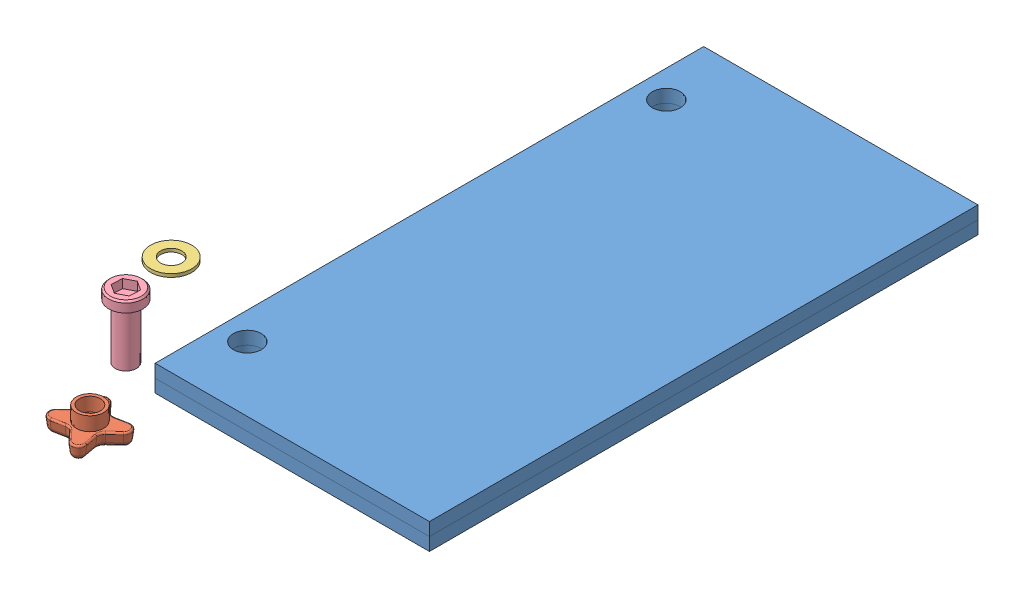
SolidWorks assembly PlateAssem1.SLDASM, configuration Default (file format 4628). Lengths in mm.
Overall size (176.96 30.99 293.86).
5 component instances, 4 part files, 5 mates.
Components (placement in the parent):
- Plate-1: Plate.SLDPRT [Default] at (-59.2503 9.0034 24.4694) size (127 6 254)
- Nut-2: Nut.SLDPRT [Default] at (-133.2012 -3.3466 171.2207) x (0.446921 0 0.894573) z (0.894573 0 -0.446921) size (29.99 12.7 29.99)
- Washer-2: Washer.SLDPRT [Default] at (-160.1384 15.0034 106.6469) x (0.913923 0 -0.405888) z (0 1 0) size (19.05 19.05 1.52)
- Cap Screw-2: Cap Screw.SLDPRT [Default] at (-153.7027 -8.8726 134.0772) x (-0.887199 0 0.461387) z (0 1 0) size (15.88 15.88 30.16)
- Plate-3: Plate.SLDPRT [Default] at (-59.2503 3.0034 24.4694) size (127 6 254)
Mates (geometry in assembly coordinates):
- Coincident2: coincident anti-aligned: plane of Plate-1 through (-122.7503 15.0034 151.4694) normal (0 1 0); plane of Washer-2 through (-160.1384 15.0034 106.6469) normal (0 -1 0)
- Coincident3: coincident anti-aligned: plane of Washer-2 through (-160.1384 16.5274 106.6469) normal (0 1 0); plane of Cap Screw-2 through (-153.7027 16.5274 134.0772) normal (0 -1 0)
- Coincident7: coincident anti-aligned: plane of Plate-1 through (-122.7503 9.0034 151.4694) normal (0 -1 0); plane of Plate-3 through (-122.7503 9.0034 151.4694) normal (0 1 0)
- Coincident12: coincident aligned: plane of Plate-1 through (4.2497 15.0034 -102.5306) normal (1 0 0); plane of Plate-3 through (4.2497 9.0034 -102.5306) normal (1 0 0)
- Coincident15: coincident anti-aligned: plane of Nut-2 through (-133.2012 3.0034 171.2207) normal (0 1 0); plane of Plate-3 through (-122.7503 3.0034 151.4694) normal (0 -1 0)
